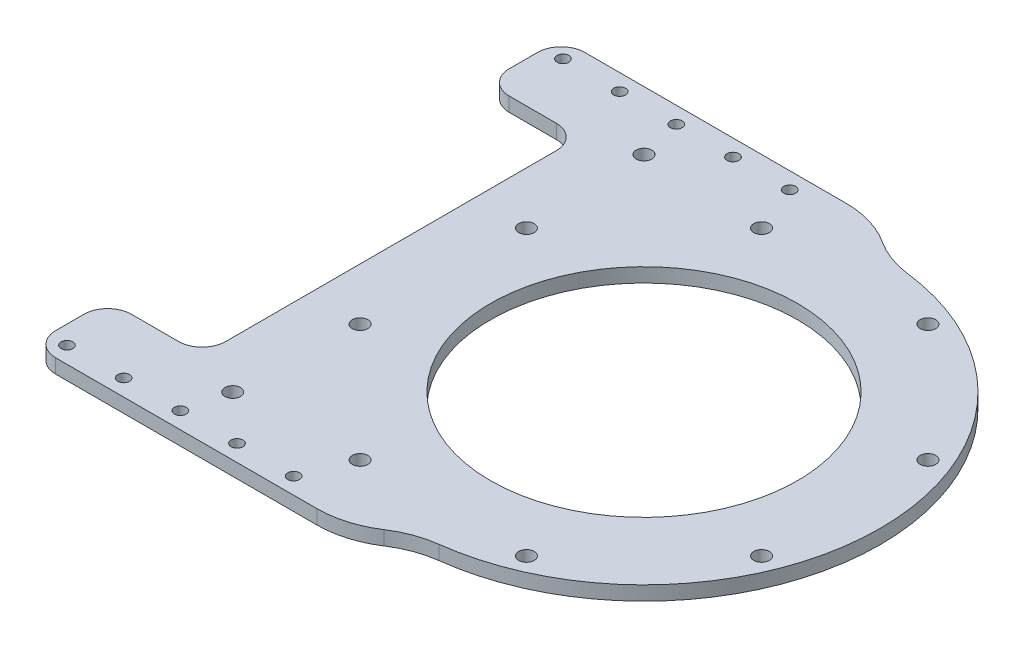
ISO-10303-21;
HEADER;
FILE_DESCRIPTION(('STEP AP214'),'2;1');
FILE_NAME('part.step','',(''),(''),'','','');
FILE_SCHEMA(('AUTOMOTIVE_DESIGN { 1 0 10303 214 1 1 1 1 }'));
ENDSEC;
DATA;
#1=APPLICATION_CONTEXT('core data for automotive mechanical design processes');
#2=APPLICATION_PROTOCOL_DEFINITION('international standard','automotive_design',2000,#1);
#3=PRODUCT_CONTEXT('',#1,'mechanical');
#4=PRODUCT('Part','Part','',(#3));
#5=PRODUCT_RELATED_PRODUCT_CATEGORY('part','',(#4));
#6=PRODUCT_DEFINITION_FORMATION('','',#4);
#7=PRODUCT_DEFINITION_CONTEXT('part definition',#1,'design');
#8=PRODUCT_DEFINITION('design','',#6,#7);
#9=PRODUCT_DEFINITION_SHAPE('','',#8);
#10=(LENGTH_UNIT() NAMED_UNIT(*) SI_UNIT(.MILLI.,.METRE.));
#11=(NAMED_UNIT(*) PLANE_ANGLE_UNIT() SI_UNIT($,.RADIAN.));
#12=(NAMED_UNIT(*) SI_UNIT($,.STERADIAN.) SOLID_ANGLE_UNIT());
#13=UNCERTAINTY_MEASURE_WITH_UNIT(LENGTH_MEASURE(1.E-05),#10,'distance_accuracy_value','');
#14=(GEOMETRIC_REPRESENTATION_CONTEXT(3) GLOBAL_UNCERTAINTY_ASSIGNED_CONTEXT((#13)) GLOBAL_UNIT_ASSIGNED_CONTEXT((#10,
#11,#12)) REPRESENTATION_CONTEXT('',''));
#15=CARTESIAN_POINT('',(0.,0.,0.));
#16=DIRECTION('',(0.,0.,1.));
#17=DIRECTION('',(1.,0.,0.));
#18=AXIS2_PLACEMENT_3D('',#15,#16,#17);
#19=CARTESIAN_POINT('',(83.4007857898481,3.,-81.060672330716));
#20=DIRECTION('',(1.,0.,0.));
#21=DIRECTION('',(0.,0.,-1.));
#22=AXIS2_PLACEMENT_3D('',#19,#20,#21);
#23=PLANE('',#22);
#24=DIRECTION('',(0.,1.,0.));
#25=VECTOR('',#24,1.);
#26=CARTESIAN_POINT('',(83.4007857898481,3.,45.));
#27=LINE('',#26,#25);
#28=CARTESIAN_POINT('',(83.4007857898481,0.,45.));
#29=VERTEX_POINT('',#28);
#30=CARTESIAN_POINT('',(83.4007857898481,3.,45.));
#31=VERTEX_POINT('',#30);
#32=EDGE_CURVE('E11',#29,#31,#27,.T.);
#33=ORIENTED_EDGE('',*,*,#32,.F.);
#34=DIRECTION('',(0.,0.,1.));
#35=VECTOR('',#34,1.);
#36=CARTESIAN_POINT('',(83.4007857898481,0.,0.));
#37=LINE('',#36,#35);
#38=CARTESIAN_POINT('',(83.4007857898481,0.,51.));
#39=VERTEX_POINT('',#38);
#40=EDGE_CURVE('E152',#39,#29,#37,.F.);
#41=ORIENTED_EDGE('',*,*,#40,.F.);
#42=DIRECTION('',(0.,1.,0.));
#43=VECTOR('',#42,1.);
#44=CARTESIAN_POINT('',(83.4007857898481,3.,51.));
#45=LINE('',#44,#43);
#46=CARTESIAN_POINT('',(83.4007857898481,3.,51.));
#47=VERTEX_POINT('',#46);
#48=EDGE_CURVE('E64',#39,#47,#45,.T.);
#49=ORIENTED_EDGE('',*,*,#48,.T.);
#50=DIRECTION('',(0.,0.,-1.));
#51=VECTOR('',#50,1.);
#52=CARTESIAN_POINT('',(83.4007857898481,3.,-81.060672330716));
#53=LINE('',#52,#51);
#54=EDGE_CURVE('E292',#47,#31,#53,.T.);
#55=ORIENTED_EDGE('',*,*,#54,.T.);
#56=EDGE_LOOP('',(#33,#41,#49,#55));
#57=FACE_BOUND('',#56,.T.);
#58=ADVANCED_FACE('F53',(#57),#23,.F.);
#59=CARTESIAN_POINT('',(88.4007857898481,3.,51.));
#60=DIRECTION('',(0.,1.,0.));
#61=DIRECTION('',(0.,0.,1.));
#62=AXIS2_PLACEMENT_3D('',#59,#60,#61);
#63=CYLINDRICAL_SURFACE('',#62,5.);
#64=ORIENTED_EDGE('',*,*,#48,.F.);
#65=CARTESIAN_POINT('',(88.4007857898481,0.,51.));
#66=DIRECTION('',(0.,1.,0.));
#67=DIRECTION('',(0.,0.,1.));
#68=AXIS2_PLACEMENT_3D('',#65,#66,#67);
#69=CIRCLE('',#68,5.);
#70=CARTESIAN_POINT('',(88.4007857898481,0.,56.));
#71=VERTEX_POINT('',#70);
#72=EDGE_CURVE('E224',#39,#71,#69,.T.);
#73=ORIENTED_EDGE('',*,*,#72,.T.);
#74=DIRECTION('',(0.,1.,0.));
#75=VECTOR('',#74,1.);
#76=CARTESIAN_POINT('',(88.4007857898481,3.,56.));
#77=LINE('',#76,#75);
#78=CARTESIAN_POINT('',(88.4007857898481,3.,56.));
#79=VERTEX_POINT('',#78);
#80=EDGE_CURVE('E283',#71,#79,#77,.T.);
#81=ORIENTED_EDGE('',*,*,#80,.T.);
#82=CARTESIAN_POINT('',(88.4007857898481,3.,51.));
#83=DIRECTION('',(0.,1.,0.));
#84=DIRECTION('',(0.,0.,1.));
#85=AXIS2_PLACEMENT_3D('',#82,#83,#84);
#86=CIRCLE('',#85,5.);
#87=EDGE_CURVE('E301',#47,#79,#86,.T.);
#88=ORIENTED_EDGE('',*,*,#87,.F.);
#89=EDGE_LOOP('',(#64,#73,#81,#88));
#90=FACE_BOUND('',#89,.T.);
#91=ADVANCED_FACE('F306',(#90),#63,.T.);
#92=CARTESIAN_POINT('',(-100.,3.,56.));
#93=DIRECTION('',(0.,0.,1.));
#94=DIRECTION('',(1.,0.,0.));
#95=AXIS2_PLACEMENT_3D('',#92,#93,#94);
#96=PLANE('',#95);
#97=ORIENTED_EDGE('',*,*,#80,.F.);
#98=DIRECTION('',(1.,0.,0.));
#99=VECTOR('',#98,1.);
#100=CARTESIAN_POINT('',(0.,0.,56.));
#101=LINE('',#100,#99);
#102=CARTESIAN_POINT('',(143.705644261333,0.,56.));
#103=VERTEX_POINT('',#102);
#104=EDGE_CURVE('E220',#71,#103,#101,.T.);
#105=ORIENTED_EDGE('',*,*,#104,.T.);
#106=DIRECTION('',(0.,1.,0.));
#107=VECTOR('',#106,1.);
#108=CARTESIAN_POINT('',(143.705644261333,3.,56.));
#109=LINE('',#108,#107);
#110=CARTESIAN_POINT('',(143.705644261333,3.,56.));
#111=VERTEX_POINT('',#110);
#112=EDGE_CURVE('E279',#103,#111,#109,.T.);
#113=ORIENTED_EDGE('',*,*,#112,.T.);
#114=DIRECTION('',(1.,0.,0.));
#115=VECTOR('',#114,1.);
#116=CARTESIAN_POINT('',(-100.,3.,56.));
#117=LINE('',#116,#115);
#118=EDGE_CURVE('E308',#79,#111,#117,.T.);
#119=ORIENTED_EDGE('',*,*,#118,.F.);
#120=EDGE_LOOP('',(#97,#105,#113,#119));
#121=FACE_BOUND('',#120,.T.);
#122=ADVANCED_FACE('F466',(#121),#96,.T.);
#123=CARTESIAN_POINT('',(143.705644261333,3.,36.));
#124=DIRECTION('',(0.,1.,0.));
#125=DIRECTION('',(0.,0.,1.));
#126=AXIS2_PLACEMENT_3D('',#123,#124,#125);
#127=CYLINDRICAL_SURFACE('',#126,20.);
#128=ORIENTED_EDGE('',*,*,#112,.F.);
#129=CARTESIAN_POINT('',(143.705644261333,0.,36.));
#130=DIRECTION('',(0.,1.,0.));
#131=DIRECTION('',(0.,0.,1.));
#132=AXIS2_PLACEMENT_3D('',#129,#130,#131);
#133=CIRCLE('',#132,20.);
#134=CARTESIAN_POINT('',(154.665979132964,0.,52.7293472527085));
#135=VERTEX_POINT('',#134);
#136=EDGE_CURVE('E216',#103,#135,#133,.T.);
#137=ORIENTED_EDGE('',*,*,#136,.T.);
#138=DIRECTION('',(0.,1.,0.));
#139=VECTOR('',#138,1.);
#140=CARTESIAN_POINT('',(154.665979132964,3.,52.7293472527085));
#141=LINE('',#140,#139);
#142=CARTESIAN_POINT('',(154.665979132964,3.,52.7293472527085));
#143=VERTEX_POINT('',#142);
#144=EDGE_CURVE('E275',#135,#143,#141,.T.);
#145=ORIENTED_EDGE('',*,*,#144,.T.);
#146=CARTESIAN_POINT('',(143.705644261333,3.,36.));
#147=DIRECTION('',(0.,1.,0.));
#148=DIRECTION('',(0.,0.,1.));
#149=AXIS2_PLACEMENT_3D('',#146,#147,#148);
#150=CIRCLE('',#149,20.);
#151=EDGE_CURVE('E313',#111,#143,#150,.T.);
#152=ORIENTED_EDGE('',*,*,#151,.F.);
#153=EDGE_LOOP('',(#128,#137,#145,#152));
#154=FACE_BOUND('',#153,.T.);
#155=ADVANCED_FACE('F958',(#154),#127,.T.);
#156=CARTESIAN_POINT('',(165.626314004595,3.,69.458694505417));
#157=DIRECTION('',(0.,1.,0.));
#158=DIRECTION('',(0.,0.,1.));
#159=AXIS2_PLACEMENT_3D('',#156,#157,#158);
#160=CYLINDRICAL_SURFACE('',#159,20.);
#161=ORIENTED_EDGE('',*,*,#144,.F.);
#162=CARTESIAN_POINT('',(165.626314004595,0.,69.458694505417));
#163=DIRECTION('',(0.,1.,0.));
#164=DIRECTION('',(0.,0.,1.));
#165=AXIS2_PLACEMENT_3D('',#162,#163,#164);
#166=CIRCLE('',#165,20.);
#167=CARTESIAN_POINT('',(163.14388994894,0.,49.613353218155));
#168=VERTEX_POINT('',#167);
#169=EDGE_CURVE('E212',#135,#168,#166,.F.);
#170=ORIENTED_EDGE('',*,*,#169,.T.);
#171=DIRECTION('',(0.,1.,0.));
#172=VECTOR('',#171,1.);
#173=CARTESIAN_POINT('',(163.14388994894,3.,49.613353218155));
#174=LINE('',#173,#172);
#175=CARTESIAN_POINT('',(163.14388994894,3.,49.613353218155));
#176=VERTEX_POINT('',#175);
#177=EDGE_CURVE('E271',#168,#176,#174,.T.);
#178=ORIENTED_EDGE('',*,*,#177,.T.);
#179=CARTESIAN_POINT('',(165.626314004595,3.,69.458694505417));
#180=DIRECTION('',(0.,1.,0.));
#181=DIRECTION('',(0.,0.,1.));
#182=AXIS2_PLACEMENT_3D('',#179,#180,#181);
#183=CIRCLE('',#182,20.);
#184=EDGE_CURVE('E320',#143,#176,#183,.F.);
#185=ORIENTED_EDGE('',*,*,#184,.F.);
#186=EDGE_LOOP('',(#161,#170,#178,#185));
#187=FACE_BOUND('',#186,.T.);
#188=ADVANCED_FACE('F948',(#187),#160,.F.);
#189=CARTESIAN_POINT('',(156.937829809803,3.,0.));
#190=DIRECTION('',(0.,1.,0.));
#191=DIRECTION('',(0.,0.,1.));
#192=AXIS2_PLACEMENT_3D('',#189,#190,#191);
#193=CYLINDRICAL_SURFACE('',#192,50.);
#194=ORIENTED_EDGE('',*,*,#177,.F.);
#195=CARTESIAN_POINT('',(156.937829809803,0.,0.));
#196=DIRECTION('',(0.,1.,0.));
#197=DIRECTION('',(0.,0.,1.));
#198=AXIS2_PLACEMENT_3D('',#195,#196,#197);
#199=CIRCLE('',#198,50.);
#200=CARTESIAN_POINT('',(163.14388994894,0.,-49.613353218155));
#201=VERTEX_POINT('',#200);
#202=EDGE_CURVE('E208',#168,#201,#199,.T.);
#203=ORIENTED_EDGE('',*,*,#202,.T.);
#204=DIRECTION('',(0.,1.,0.));
#205=VECTOR('',#204,1.);
#206=CARTESIAN_POINT('',(163.14388994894,3.,-49.613353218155));
#207=LINE('',#206,#205);
#208=CARTESIAN_POINT('',(163.14388994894,3.,-49.613353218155));
#209=VERTEX_POINT('',#208);
#210=EDGE_CURVE('E267',#201,#209,#207,.T.);
#211=ORIENTED_EDGE('',*,*,#210,.T.);
#212=CARTESIAN_POINT('',(156.937829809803,3.,0.));
#213=DIRECTION('',(0.,1.,0.));
#214=DIRECTION('',(0.,0.,1.));
#215=AXIS2_PLACEMENT_3D('',#212,#213,#214);
#216=CIRCLE('',#215,50.);
#217=EDGE_CURVE('E324',#176,#209,#216,.T.);
#218=ORIENTED_EDGE('',*,*,#217,.F.);
#219=EDGE_LOOP('',(#194,#203,#211,#218));
#220=FACE_BOUND('',#219,.T.);
#221=ADVANCED_FACE('F939',(#220),#193,.T.);
#222=CARTESIAN_POINT('',(165.626314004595,3.,-69.458694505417));
#223=DIRECTION('',(0.,1.,0.));
#224=DIRECTION('',(0.,0.,1.));
#225=AXIS2_PLACEMENT_3D('',#222,#223,#224);
#226=CYLINDRICAL_SURFACE('',#225,20.);
#227=ORIENTED_EDGE('',*,*,#210,.F.);
#228=CARTESIAN_POINT('',(165.626314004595,0.,-69.458694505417));
#229=DIRECTION('',(0.,1.,0.));
#230=DIRECTION('',(0.,0.,1.));
#231=AXIS2_PLACEMENT_3D('',#228,#229,#230);
#232=CIRCLE('',#231,20.);
#233=CARTESIAN_POINT('',(154.665979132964,0.,-52.7293472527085));
#234=VERTEX_POINT('',#233);
#235=EDGE_CURVE('E204',#201,#234,#232,.F.);
#236=ORIENTED_EDGE('',*,*,#235,.T.);
#237=DIRECTION('',(0.,1.,0.));
#238=VECTOR('',#237,1.);
#239=CARTESIAN_POINT('',(154.665979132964,3.,-52.7293472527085));
#240=LINE('',#239,#238);
#241=CARTESIAN_POINT('',(154.665979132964,3.,-52.7293472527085));
#242=VERTEX_POINT('',#241);
#243=EDGE_CURVE('E263',#234,#242,#240,.T.);
#244=ORIENTED_EDGE('',*,*,#243,.T.);
#245=CARTESIAN_POINT('',(165.626314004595,3.,-69.458694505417));
#246=DIRECTION('',(0.,1.,0.));
#247=DIRECTION('',(0.,0.,1.));
#248=AXIS2_PLACEMENT_3D('',#245,#246,#247);
#249=CIRCLE('',#248,20.);
#250=EDGE_CURVE('E328',#209,#242,#249,.F.);
#251=ORIENTED_EDGE('',*,*,#250,.F.);
#252=EDGE_LOOP('',(#227,#236,#244,#251));
#253=FACE_BOUND('',#252,.T.);
#254=ADVANCED_FACE('F930',(#253),#226,.F.);
#255=CARTESIAN_POINT('',(143.705644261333,3.,-36.));
#256=DIRECTION('',(0.,1.,0.));
#257=DIRECTION('',(0.,0.,1.));
#258=AXIS2_PLACEMENT_3D('',#255,#256,#257);
#259=CYLINDRICAL_SURFACE('',#258,20.);
#260=ORIENTED_EDGE('',*,*,#243,.F.);
#261=CARTESIAN_POINT('',(143.705644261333,0.,-36.));
#262=DIRECTION('',(0.,1.,0.));
#263=DIRECTION('',(0.,0.,1.));
#264=AXIS2_PLACEMENT_3D('',#261,#262,#263);
#265=CIRCLE('',#264,20.);
#266=CARTESIAN_POINT('',(143.705644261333,0.,-56.));
#267=VERTEX_POINT('',#266);
#268=EDGE_CURVE('E200',#234,#267,#265,.T.);
#269=ORIENTED_EDGE('',*,*,#268,.T.);
#270=DIRECTION('',(0.,1.,0.));
#271=VECTOR('',#270,1.);
#272=CARTESIAN_POINT('',(143.705644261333,3.,-56.));
#273=LINE('',#272,#271);
#274=CARTESIAN_POINT('',(143.705644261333,3.,-56.));
#275=VERTEX_POINT('',#274);
#276=EDGE_CURVE('E259',#267,#275,#273,.T.);
#277=ORIENTED_EDGE('',*,*,#276,.T.);
#278=CARTESIAN_POINT('',(143.705644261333,3.,-36.));
#279=DIRECTION('',(0.,1.,0.));
#280=DIRECTION('',(0.,0.,1.));
#281=AXIS2_PLACEMENT_3D('',#278,#279,#280);
#282=CIRCLE('',#281,20.);
#283=EDGE_CURVE('E332',#242,#275,#282,.T.);
#284=ORIENTED_EDGE('',*,*,#283,.F.);
#285=EDGE_LOOP('',(#260,#269,#277,#284));
#286=FACE_BOUND('',#285,.T.);
#287=ADVANCED_FACE('F498',(#286),#259,.T.);
#288=CARTESIAN_POINT('',(-100.,3.,-56.));
#289=DIRECTION('',(0.,0.,-1.));
#290=DIRECTION('',(-1.,0.,0.));
#291=AXIS2_PLACEMENT_3D('',#288,#289,#290);
#292=PLANE('',#291);
#293=ORIENTED_EDGE('',*,*,#276,.F.);
#294=DIRECTION('',(1.,0.,0.));
#295=VECTOR('',#294,1.);
#296=CARTESIAN_POINT('',(0.,0.,-56.));
#297=LINE('',#296,#295);
#298=CARTESIAN_POINT('',(88.4007857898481,0.,-56.));
#299=VERTEX_POINT('',#298);
#300=EDGE_CURVE('E196',#267,#299,#297,.F.);
#301=ORIENTED_EDGE('',*,*,#300,.T.);
#302=DIRECTION('',(0.,1.,0.));
#303=VECTOR('',#302,1.);
#304=CARTESIAN_POINT('',(88.4007857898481,3.,-56.));
#305=LINE('',#304,#303);
#306=CARTESIAN_POINT('',(88.4007857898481,3.,-56.));
#307=VERTEX_POINT('',#306);
#308=EDGE_CURVE('E255',#299,#307,#305,.T.);
#309=ORIENTED_EDGE('',*,*,#308,.T.);
#310=DIRECTION('',(-1.,0.,0.));
#311=VECTOR('',#310,1.);
#312=CARTESIAN_POINT('',(-100.,3.,-56.));
#313=LINE('',#312,#311);
#314=EDGE_CURVE('E336',#275,#307,#313,.T.);
#315=ORIENTED_EDGE('',*,*,#314,.F.);
#316=EDGE_LOOP('',(#293,#301,#309,#315));
#317=FACE_BOUND('',#316,.T.);
#318=ADVANCED_FACE('F478',(#317),#292,.T.);
#319=CARTESIAN_POINT('',(88.4007857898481,3.,-51.));
#320=DIRECTION('',(0.,1.,0.));
#321=DIRECTION('',(0.,0.,1.));
#322=AXIS2_PLACEMENT_3D('',#319,#320,#321);
#323=CYLINDRICAL_SURFACE('',#322,5.);
#324=ORIENTED_EDGE('',*,*,#308,.F.);
#325=CARTESIAN_POINT('',(88.4007857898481,0.,-51.));
#326=DIRECTION('',(0.,1.,0.));
#327=DIRECTION('',(0.,0.,1.));
#328=AXIS2_PLACEMENT_3D('',#325,#326,#327);
#329=CIRCLE('',#328,5.);
#330=CARTESIAN_POINT('',(83.4007857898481,0.,-51.));
#331=VERTEX_POINT('',#330);
#332=EDGE_CURVE('E192',#299,#331,#329,.T.);
#333=ORIENTED_EDGE('',*,*,#332,.T.);
#334=DIRECTION('',(0.,1.,0.));
#335=VECTOR('',#334,1.);
#336=CARTESIAN_POINT('',(83.4007857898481,3.,-51.));
#337=LINE('',#336,#335);
#338=CARTESIAN_POINT('',(83.4007857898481,3.,-51.));
#339=VERTEX_POINT('',#338);
#340=EDGE_CURVE('E251',#331,#339,#337,.T.);
#341=ORIENTED_EDGE('',*,*,#340,.T.);
#342=CARTESIAN_POINT('',(88.4007857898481,3.,-51.));
#343=DIRECTION('',(0.,1.,0.));
#344=DIRECTION('',(0.,0.,1.));
#345=AXIS2_PLACEMENT_3D('',#342,#343,#344);
#346=CIRCLE('',#345,5.);
#347=EDGE_CURVE('E340',#307,#339,#346,.T.);
#348=ORIENTED_EDGE('',*,*,#347,.F.);
#349=EDGE_LOOP('',(#324,#333,#341,#348));
#350=FACE_BOUND('',#349,.T.);
#351=ADVANCED_FACE('F471',(#350),#323,.T.);
#352=ORIENTED_EDGE('',*,*,#340,.F.);
#353=DIRECTION('',(0.,0.,1.));
#354=VECTOR('',#353,1.);
#355=CARTESIAN_POINT('',(83.4007857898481,0.,0.));
#356=LINE('',#355,#354);
#357=CARTESIAN_POINT('',(83.4007857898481,0.,-45.));
#358=VERTEX_POINT('',#357);
#359=EDGE_CURVE('E188',#358,#331,#356,.F.);
#360=ORIENTED_EDGE('',*,*,#359,.F.);
#361=DIRECTION('',(0.,1.,0.));
#362=VECTOR('',#361,1.);
#363=CARTESIAN_POINT('',(83.4007857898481,3.,-45.));
#364=LINE('',#363,#362);
#365=CARTESIAN_POINT('',(83.4007857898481,3.,-45.));
#366=VERTEX_POINT('',#365);
#367=EDGE_CURVE('E247',#358,#366,#364,.T.);
#368=ORIENTED_EDGE('',*,*,#367,.T.);
#369=EDGE_CURVE('E305',#366,#339,#53,.T.);
#370=ORIENTED_EDGE('',*,*,#369,.T.);
#371=EDGE_LOOP('',(#352,#360,#368,#370));
#372=FACE_BOUND('',#371,.T.);
#373=ADVANCED_FACE('F463',(#372),#23,.F.);
#374=CARTESIAN_POINT('',(88.4007857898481,3.,-45.));
#375=DIRECTION('',(0.,1.,0.));
#376=DIRECTION('',(0.,0.,1.));
#377=AXIS2_PLACEMENT_3D('',#374,#375,#376);
#378=CYLINDRICAL_SURFACE('',#377,5.);
#379=ORIENTED_EDGE('',*,*,#367,.F.);
#380=CARTESIAN_POINT('',(88.4007857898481,0.,-45.));
#381=DIRECTION('',(0.,1.,0.));
#382=DIRECTION('',(0.,0.,1.));
#383=AXIS2_PLACEMENT_3D('',#380,#381,#382);
#384=CIRCLE('',#383,5.);
#385=CARTESIAN_POINT('',(88.4007857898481,0.,-40.));
#386=VERTEX_POINT('',#385);
#387=EDGE_CURVE('E184',#358,#386,#384,.T.);
#388=ORIENTED_EDGE('',*,*,#387,.T.);
#389=DIRECTION('',(0.,1.,0.));
#390=VECTOR('',#389,1.);
#391=CARTESIAN_POINT('',(88.4007857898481,3.,-40.));
#392=LINE('',#391,#390);
#393=CARTESIAN_POINT('',(88.4007857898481,3.,-40.));
#394=VERTEX_POINT('',#393);
#395=EDGE_CURVE('E243',#386,#394,#392,.T.);
#396=ORIENTED_EDGE('',*,*,#395,.T.);
#397=CARTESIAN_POINT('',(88.4007857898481,3.,-45.));
#398=DIRECTION('',(0.,1.,0.));
#399=DIRECTION('',(0.,0.,1.));
#400=AXIS2_PLACEMENT_3D('',#397,#398,#399);
#401=CIRCLE('',#400,5.);
#402=EDGE_CURVE('E344',#366,#394,#401,.T.);
#403=ORIENTED_EDGE('',*,*,#402,.F.);
#404=EDGE_LOOP('',(#379,#388,#396,#403));
#405=FACE_BOUND('',#404,.T.);
#406=ADVANCED_FACE('F470',(#405),#378,.T.);
#407=CARTESIAN_POINT('',(0.,3.,-40.));
#408=DIRECTION('',(0.,0.,-1.));
#409=DIRECTION('',(-1.,0.,0.));
#410=AXIS2_PLACEMENT_3D('',#407,#408,#409);
#411=PLANE('',#410);
#412=ORIENTED_EDGE('',*,*,#395,.F.);
#413=DIRECTION('',(1.,0.,0.));
#414=VECTOR('',#413,1.);
#415=CARTESIAN_POINT('',(0.,0.,-40.));
#416=LINE('',#415,#414);
#417=CARTESIAN_POINT('',(98.4007857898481,0.,-40.));
#418=VERTEX_POINT('',#417);
#419=EDGE_CURVE('E180',#418,#386,#416,.F.);
#420=ORIENTED_EDGE('',*,*,#419,.F.);
#421=DIRECTION('',(0.,1.,0.));
#422=VECTOR('',#421,1.);
#423=CARTESIAN_POINT('',(98.4007857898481,3.,-40.));
#424=LINE('',#423,#422);
#425=CARTESIAN_POINT('',(98.4007857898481,3.,-40.));
#426=VERTEX_POINT('',#425);
#427=EDGE_CURVE('E239',#418,#426,#424,.T.);
#428=ORIENTED_EDGE('',*,*,#427,.T.);
#429=DIRECTION('',(-1.,0.,0.));
#430=VECTOR('',#429,1.);
#431=CARTESIAN_POINT('',(0.,3.,-40.));
#432=LINE('',#431,#430);
#433=EDGE_CURVE('E348',#426,#394,#432,.T.);
#434=ORIENTED_EDGE('',*,*,#433,.T.);
#435=EDGE_LOOP('',(#412,#420,#428,#434));
#436=FACE_BOUND('',#435,.T.);
#437=ADVANCED_FACE('F476',(#436),#411,.F.);
#438=CARTESIAN_POINT('',(98.4007857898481,3.,-35.));
#439=DIRECTION('',(0.,1.,0.));
#440=DIRECTION('',(0.,0.,1.));
#441=AXIS2_PLACEMENT_3D('',#438,#439,#440);
#442=CYLINDRICAL_SURFACE('',#441,5.);
#443=ORIENTED_EDGE('',*,*,#427,.F.);
#444=CARTESIAN_POINT('',(98.4007857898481,0.,-35.));
#445=DIRECTION('',(0.,1.,0.));
#446=DIRECTION('',(0.,0.,1.));
#447=AXIS2_PLACEMENT_3D('',#444,#445,#446);
#448=CIRCLE('',#447,5.);
#449=CARTESIAN_POINT('',(103.400785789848,0.,-35.));
#450=VERTEX_POINT('',#449);
#451=EDGE_CURVE('E176',#418,#450,#448,.F.);
#452=ORIENTED_EDGE('',*,*,#451,.T.);
#453=DIRECTION('',(0.,1.,0.));
#454=VECTOR('',#453,1.);
#455=CARTESIAN_POINT('',(103.400785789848,3.,-35.));
#456=LINE('',#455,#454);
#457=CARTESIAN_POINT('',(103.400785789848,3.,-35.));
#458=VERTEX_POINT('',#457);
#459=EDGE_CURVE('E235',#450,#458,#456,.T.);
#460=ORIENTED_EDGE('',*,*,#459,.T.);
#461=CARTESIAN_POINT('',(98.4007857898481,3.,-35.));
#462=DIRECTION('',(0.,1.,0.));
#463=DIRECTION('',(0.,0.,1.));
#464=AXIS2_PLACEMENT_3D('',#461,#462,#463);
#465=CIRCLE('',#464,5.);
#466=EDGE_CURVE('E352',#426,#458,#465,.F.);
#467=ORIENTED_EDGE('',*,*,#466,.F.);
#468=EDGE_LOOP('',(#443,#452,#460,#467));
#469=FACE_BOUND('',#468,.T.);
#470=ADVANCED_FACE('F515',(#469),#442,.F.);
#471=CARTESIAN_POINT('',(103.400785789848,3.,0.));
#472=DIRECTION('',(1.,0.,0.));
#473=DIRECTION('',(0.,0.,-1.));
#474=AXIS2_PLACEMENT_3D('',#471,#472,#473);
#475=PLANE('',#474);
#476=ORIENTED_EDGE('',*,*,#459,.F.);
#477=DIRECTION('',(0.,0.,1.));
#478=VECTOR('',#477,1.);
#479=CARTESIAN_POINT('',(103.400785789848,0.,0.));
#480=LINE('',#479,#478);
#481=CARTESIAN_POINT('',(103.400785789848,0.,35.));
#482=VERTEX_POINT('',#481);
#483=EDGE_CURVE('E172',#482,#450,#480,.F.);
#484=ORIENTED_EDGE('',*,*,#483,.F.);
#485=DIRECTION('',(0.,1.,0.));
#486=VECTOR('',#485,1.);
#487=CARTESIAN_POINT('',(103.400785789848,3.,35.));
#488=LINE('',#487,#486);
#489=CARTESIAN_POINT('',(103.400785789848,3.,35.));
#490=VERTEX_POINT('',#489);
#491=EDGE_CURVE('E232',#482,#490,#488,.T.);
#492=ORIENTED_EDGE('',*,*,#491,.T.);
#493=DIRECTION('',(0.,0.,-1.));
#494=VECTOR('',#493,1.);
#495=CARTESIAN_POINT('',(103.400785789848,3.,0.));
#496=LINE('',#495,#494);
#497=EDGE_CURVE('E356',#490,#458,#496,.T.);
#498=ORIENTED_EDGE('',*,*,#497,.T.);
#499=EDGE_LOOP('',(#476,#484,#492,#498));
#500=FACE_BOUND('',#499,.T.);
#501=ADVANCED_FACE('F521',(#500),#475,.F.);
#502=CARTESIAN_POINT('',(98.4007857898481,3.,35.));
#503=DIRECTION('',(0.,1.,0.));
#504=DIRECTION('',(0.,0.,1.));
#505=AXIS2_PLACEMENT_3D('',#502,#503,#504);
#506=CYLINDRICAL_SURFACE('',#505,5.);
#507=ORIENTED_EDGE('',*,*,#491,.F.);
#508=CARTESIAN_POINT('',(98.4007857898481,0.,35.));
#509=DIRECTION('',(0.,1.,0.));
#510=DIRECTION('',(0.,0.,1.));
#511=AXIS2_PLACEMENT_3D('',#508,#509,#510);
#512=CIRCLE('',#511,5.);
#513=CARTESIAN_POINT('',(98.4007857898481,0.,40.));
#514=VERTEX_POINT('',#513);
#515=EDGE_CURVE('E168',#482,#514,#512,.F.);
#516=ORIENTED_EDGE('',*,*,#515,.T.);
#517=DIRECTION('',(0.,1.,0.));
#518=VECTOR('',#517,1.);
#519=CARTESIAN_POINT('',(98.4007857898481,3.,40.));
#520=LINE('',#519,#518);
#521=CARTESIAN_POINT('',(98.4007857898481,3.,40.));
#522=VERTEX_POINT('',#521);
#523=EDGE_CURVE('E72',#514,#522,#520,.T.);
#524=ORIENTED_EDGE('',*,*,#523,.T.);
#525=CARTESIAN_POINT('',(98.4007857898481,3.,35.));
#526=DIRECTION('',(0.,1.,0.));
#527=DIRECTION('',(0.,0.,1.));
#528=AXIS2_PLACEMENT_3D('',#525,#526,#527);
#529=CIRCLE('',#528,5.);
#530=EDGE_CURVE('E145',#490,#522,#529,.F.);
#531=ORIENTED_EDGE('',*,*,#530,.F.);
#532=EDGE_LOOP('',(#507,#516,#524,#531));
#533=FACE_BOUND('',#532,.T.);
#534=ADVANCED_FACE('F522',(#533),#506,.F.);
#535=CARTESIAN_POINT('',(0.,3.,40.));
#536=DIRECTION('',(0.,0.,-1.));
#537=DIRECTION('',(-1.,0.,0.));
#538=AXIS2_PLACEMENT_3D('',#535,#536,#537);
#539=PLANE('',#538);
#540=ORIENTED_EDGE('',*,*,#523,.F.);
#541=DIRECTION('',(1.,0.,0.));
#542=VECTOR('',#541,1.);
#543=CARTESIAN_POINT('',(0.,0.,40.));
#544=LINE('',#543,#542);
#545=CARTESIAN_POINT('',(88.4007857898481,0.,40.));
#546=VERTEX_POINT('',#545);
#547=EDGE_CURVE('E150',#514,#546,#544,.F.);
#548=ORIENTED_EDGE('',*,*,#547,.T.);
#549=DIRECTION('',(0.,1.,0.));
#550=VECTOR('',#549,1.);
#551=CARTESIAN_POINT('',(88.4007857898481,3.,40.));
#552=LINE('',#551,#550);
#553=CARTESIAN_POINT('',(88.4007857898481,3.,40.));
#554=VERTEX_POINT('',#553);
#555=EDGE_CURVE('E57',#546,#554,#552,.T.);
#556=ORIENTED_EDGE('',*,*,#555,.T.);
#557=DIRECTION('',(-1.,0.,0.));
#558=VECTOR('',#557,1.);
#559=CARTESIAN_POINT('',(0.,3.,40.));
#560=LINE('',#559,#558);
#561=EDGE_CURVE('E523',#522,#554,#560,.T.);
#562=ORIENTED_EDGE('',*,*,#561,.F.);
#563=EDGE_LOOP('',(#540,#548,#556,#562));
#564=FACE_BOUND('',#563,.T.);
#565=ADVANCED_FACE('F155',(#564),#539,.T.);
#566=CARTESIAN_POINT('',(99.2778298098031,3.,52.4999999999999));
#567=DIRECTION('',(0.,1.,0.));
#568=DIRECTION('',(0.,0.,1.));
#569=AXIS2_PLACEMENT_3D('',#566,#567,#568);
#570=CYLINDRICAL_SURFACE('',#569,1.25);
#571=CARTESIAN_POINT('',(99.2778298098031,3.,52.4999999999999));
#572=DIRECTION('',(0.,-1.,0.));
#573=DIRECTION('',(0.,0.,-1.));
#574=AXIS2_PLACEMENT_3D('',#571,#572,#573);
#575=CIRCLE('',#574,1.25);
#576=CARTESIAN_POINT('',(99.2778298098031,3.,51.2499999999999));
#577=VERTEX_POINT('',#576);
#578=EDGE_CURVE('E171',#577,#577,#575,.T.);
#579=ORIENTED_EDGE('',*,*,#578,.F.);
#580=EDGE_LOOP('',(#579));
#581=FACE_BOUND('',#580,.T.);
#582=CARTESIAN_POINT('',(99.2778298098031,0.,52.4999999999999));
#583=DIRECTION('',(0.,-1.,0.));
#584=DIRECTION('',(0.,0.,-1.));
#585=AXIS2_PLACEMENT_3D('',#582,#583,#584);
#586=CIRCLE('',#585,1.25);
#587=CARTESIAN_POINT('',(99.2778298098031,0.,51.2499999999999));
#588=VERTEX_POINT('',#587);
#589=EDGE_CURVE('E363',#588,#588,#586,.T.);
#590=ORIENTED_EDGE('',*,*,#589,.T.);
#591=EDGE_LOOP('',(#590));
#592=FACE_BOUND('',#591,.T.);
#593=ADVANCED_FACE('F613',(#581,#592),#570,.F.);
#594=CARTESIAN_POINT('',(135.277829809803,3.,52.5));
#595=DIRECTION('',(0.,1.,0.));
#596=DIRECTION('',(0.,0.,1.));
#597=AXIS2_PLACEMENT_3D('',#594,#595,#596);
#598=CYLINDRICAL_SURFACE('',#597,1.25000000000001);
#599=CARTESIAN_POINT('',(135.277829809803,3.,52.5));
#600=DIRECTION('',(0.,1.,0.));
#601=DIRECTION('',(0.,0.,1.));
#602=AXIS2_PLACEMENT_3D('',#599,#600,#601);
#603=CIRCLE('',#602,1.25000000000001);
#604=CARTESIAN_POINT('',(135.277829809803,3.,53.75));
#605=VERTEX_POINT('',#604);
#606=EDGE_CURVE('E602',#605,#605,#603,.F.);
#607=ORIENTED_EDGE('',*,*,#606,.F.);
#608=EDGE_LOOP('',(#607));
#609=FACE_BOUND('',#608,.T.);
#610=CARTESIAN_POINT('',(135.277829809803,0.,52.5));
#611=DIRECTION('',(0.,1.,0.));
#612=DIRECTION('',(0.,0.,1.));
#613=AXIS2_PLACEMENT_3D('',#610,#611,#612);
#614=CIRCLE('',#613,1.25000000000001);
#615=CARTESIAN_POINT('',(135.277829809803,0.,53.75));
#616=VERTEX_POINT('',#615);
#617=EDGE_CURVE('E367',#616,#616,#614,.F.);
#618=ORIENTED_EDGE('',*,*,#617,.T.);
#619=EDGE_LOOP('',(#618));
#620=FACE_BOUND('',#619,.T.);
#621=ADVANCED_FACE('F616',(#609,#620),#598,.F.);
#622=CARTESIAN_POINT('',(123.277829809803,3.,52.4999999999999));
#623=DIRECTION('',(0.,1.,0.));
#624=DIRECTION('',(0.,0.,1.));
#625=AXIS2_PLACEMENT_3D('',#622,#623,#624);
#626=CYLINDRICAL_SURFACE('',#625,1.25);
#627=CARTESIAN_POINT('',(123.277829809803,3.,52.4999999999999));
#628=DIRECTION('',(0.,1.,0.));
#629=DIRECTION('',(0.,0.,1.));
#630=AXIS2_PLACEMENT_3D('',#627,#628,#629);
#631=CIRCLE('',#630,1.25);
#632=CARTESIAN_POINT('',(123.277829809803,3.,53.7499999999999));
#633=VERTEX_POINT('',#632);
#634=EDGE_CURVE('E598',#633,#633,#631,.F.);
#635=ORIENTED_EDGE('',*,*,#634,.F.);
#636=EDGE_LOOP('',(#635));
#637=FACE_BOUND('',#636,.T.);
#638=CARTESIAN_POINT('',(123.277829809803,0.,52.4999999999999));
#639=DIRECTION('',(0.,1.,0.));
#640=DIRECTION('',(0.,0.,1.));
#641=AXIS2_PLACEMENT_3D('',#638,#639,#640);
#642=CIRCLE('',#641,1.25);
#643=CARTESIAN_POINT('',(123.277829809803,0.,53.7499999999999));
#644=VERTEX_POINT('',#643);
#645=EDGE_CURVE('E371',#644,#644,#642,.F.);
#646=ORIENTED_EDGE('',*,*,#645,.T.);
#647=EDGE_LOOP('',(#646));
#648=FACE_BOUND('',#647,.T.);
#649=ADVANCED_FACE('F720',(#637,#648),#626,.F.);
#650=CARTESIAN_POINT('',(87.2778298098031,3.,52.5));
#651=DIRECTION('',(0.,1.,0.));
#652=DIRECTION('',(0.,0.,1.));
#653=AXIS2_PLACEMENT_3D('',#650,#651,#652);
#654=CYLINDRICAL_SURFACE('',#653,1.25);
#655=CARTESIAN_POINT('',(87.2778298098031,3.,52.5));
#656=DIRECTION('',(0.,-1.,0.));
#657=DIRECTION('',(0.,0.,-1.));
#658=AXIS2_PLACEMENT_3D('',#655,#656,#657);
#659=CIRCLE('',#658,1.25);
#660=CARTESIAN_POINT('',(87.2778298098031,3.,51.25));
#661=VERTEX_POINT('',#660);
#662=EDGE_CURVE('E594',#661,#661,#659,.T.);
#663=ORIENTED_EDGE('',*,*,#662,.F.);
#664=EDGE_LOOP('',(#663));
#665=FACE_BOUND('',#664,.T.);
#666=CARTESIAN_POINT('',(87.2778298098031,0.,52.5));
#667=DIRECTION('',(0.,-1.,0.));
#668=DIRECTION('',(0.,0.,-1.));
#669=AXIS2_PLACEMENT_3D('',#666,#667,#668);
#670=CIRCLE('',#669,1.25);
#671=CARTESIAN_POINT('',(87.2778298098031,0.,51.25));
#672=VERTEX_POINT('',#671);
#673=EDGE_CURVE('E375',#672,#672,#670,.T.);
#674=ORIENTED_EDGE('',*,*,#673,.T.);
#675=EDGE_LOOP('',(#674));
#676=FACE_BOUND('',#675,.T.);
#677=ADVANCED_FACE('F716',(#665,#676),#654,.F.);
#678=CARTESIAN_POINT('',(111.277829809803,3.,52.4999999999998));
#679=DIRECTION('',(0.,1.,0.));
#680=DIRECTION('',(0.,0.,1.));
#681=AXIS2_PLACEMENT_3D('',#678,#679,#680);
#682=CYLINDRICAL_SURFACE('',#681,1.25);
#683=CARTESIAN_POINT('',(111.277829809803,3.,52.4999999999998));
#684=DIRECTION('',(0.,1.,0.));
#685=DIRECTION('',(0.,0.,1.));
#686=AXIS2_PLACEMENT_3D('',#683,#684,#685);
#687=CIRCLE('',#686,1.25);
#688=CARTESIAN_POINT('',(111.277829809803,3.,53.7499999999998));
#689=VERTEX_POINT('',#688);
#690=EDGE_CURVE('E590',#689,#689,#687,.F.);
#691=ORIENTED_EDGE('',*,*,#690,.F.);
#692=EDGE_LOOP('',(#691));
#693=FACE_BOUND('',#692,.T.);
#694=CARTESIAN_POINT('',(111.277829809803,0.,52.4999999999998));
#695=DIRECTION('',(0.,1.,0.));
#696=DIRECTION('',(0.,0.,1.));
#697=AXIS2_PLACEMENT_3D('',#694,#695,#696);
#698=CIRCLE('',#697,1.25);
#699=CARTESIAN_POINT('',(111.277829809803,0.,53.7499999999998));
#700=VERTEX_POINT('',#699);
#701=EDGE_CURVE('E379',#700,#700,#698,.F.);
#702=ORIENTED_EDGE('',*,*,#701,.T.);
#703=EDGE_LOOP('',(#702));
#704=FACE_BOUND('',#703,.T.);
#705=ADVANCED_FACE('F712',(#693,#704),#682,.F.);
#706=CARTESIAN_POINT('',(156.937829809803,3.,0.));
#707=DIRECTION('',(0.,1.,0.));
#708=DIRECTION('',(0.,0.,1.));
#709=AXIS2_PLACEMENT_3D('',#706,#707,#708);
#710=CYLINDRICAL_SURFACE('',#709,32.5);
#711=CARTESIAN_POINT('',(156.937829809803,3.,0.));
#712=DIRECTION('',(0.,1.,0.));
#713=DIRECTION('',(0.,0.,1.));
#714=AXIS2_PLACEMENT_3D('',#711,#712,#713);
#715=CIRCLE('',#714,32.5);
#716=CARTESIAN_POINT('',(156.937829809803,3.,32.5));
#717=VERTEX_POINT('',#716);
#718=EDGE_CURVE('E586',#717,#717,#715,.T.);
#719=ORIENTED_EDGE('',*,*,#718,.T.);
#720=EDGE_LOOP('',(#719));
#721=FACE_BOUND('',#720,.T.);
#722=CARTESIAN_POINT('',(156.937829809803,0.,0.));
#723=DIRECTION('',(0.,1.,0.));
#724=DIRECTION('',(0.,0.,1.));
#725=AXIS2_PLACEMENT_3D('',#722,#723,#724);
#726=CIRCLE('',#725,32.5);
#727=CARTESIAN_POINT('',(156.937829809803,0.,32.5));
#728=VERTEX_POINT('',#727);
#729=EDGE_CURVE('E383',#728,#728,#726,.T.);
#730=ORIENTED_EDGE('',*,*,#729,.F.);
#731=EDGE_LOOP('',(#730));
#732=FACE_BOUND('',#731,.T.);
#733=ADVANCED_FACE('F708',(#721,#732),#710,.F.);
#734=CARTESIAN_POINT('',(113.400785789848,3.,43.5370440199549));
#735=DIRECTION('',(0.,1.,0.));
#736=DIRECTION('',(0.,0.,1.));
#737=AXIS2_PLACEMENT_3D('',#734,#735,#736);
#738=CYLINDRICAL_SURFACE('',#737,1.65);
#739=CARTESIAN_POINT('',(113.400785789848,3.,43.5370440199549));
#740=DIRECTION('',(0.,1.,0.));
#741=DIRECTION('',(0.,0.,1.));
#742=AXIS2_PLACEMENT_3D('',#739,#740,#741);
#743=CIRCLE('',#742,1.65);
#744=CARTESIAN_POINT('',(113.400785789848,3.,45.1870440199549));
#745=VERTEX_POINT('',#744);
#746=EDGE_CURVE('E582',#745,#745,#743,.F.);
#747=ORIENTED_EDGE('',*,*,#746,.F.);
#748=EDGE_LOOP('',(#747));
#749=FACE_BOUND('',#748,.T.);
#750=CARTESIAN_POINT('',(113.400785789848,0.,43.5370440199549));
#751=DIRECTION('',(0.,1.,0.));
#752=DIRECTION('',(0.,0.,1.));
#753=AXIS2_PLACEMENT_3D('',#750,#751,#752);
#754=CIRCLE('',#753,1.65);
#755=CARTESIAN_POINT('',(113.400785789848,0.,45.1870440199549));
#756=VERTEX_POINT('',#755);
#757=EDGE_CURVE('E387',#756,#756,#754,.F.);
#758=ORIENTED_EDGE('',*,*,#757,.T.);
#759=EDGE_LOOP('',(#758));
#760=FACE_BOUND('',#759,.T.);
#761=ADVANCED_FACE('F704',(#749,#760),#738,.F.);
#762=CARTESIAN_POINT('',(139.335954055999,3.,42.4991055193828));
#763=DIRECTION('',(0.,1.,0.));
#764=DIRECTION('',(0.,0.,1.));
#765=AXIS2_PLACEMENT_3D('',#762,#763,#764);
#766=CYLINDRICAL_SURFACE('',#765,1.65000000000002);
#767=CARTESIAN_POINT('',(139.335954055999,3.,42.4991055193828));
#768=DIRECTION('',(0.,1.,0.));
#769=DIRECTION('',(0.,0.,1.));
#770=AXIS2_PLACEMENT_3D('',#767,#768,#769);
#771=CIRCLE('',#770,1.65000000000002);
#772=CARTESIAN_POINT('',(139.335954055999,3.,44.1491055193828));
#773=VERTEX_POINT('',#772);
#774=EDGE_CURVE('E578',#773,#773,#771,.T.);
#775=ORIENTED_EDGE('',*,*,#774,.T.);
#776=EDGE_LOOP('',(#775));
#777=FACE_BOUND('',#776,.T.);
#778=CARTESIAN_POINT('',(139.335954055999,0.,42.4991055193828));
#779=DIRECTION('',(0.,1.,0.));
#780=DIRECTION('',(0.,0.,1.));
#781=AXIS2_PLACEMENT_3D('',#778,#779,#780);
#782=CIRCLE('',#781,1.65000000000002);
#783=CARTESIAN_POINT('',(139.335954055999,0.,44.1491055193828));
#784=VERTEX_POINT('',#783);
#785=EDGE_CURVE('E391',#784,#784,#782,.T.);
#786=ORIENTED_EDGE('',*,*,#785,.F.);
#787=EDGE_LOOP('',(#786));
#788=FACE_BOUND('',#787,.T.);
#789=ADVANCED_FACE('F700',(#777,#788),#766,.F.);
#790=CARTESIAN_POINT('',(174.539705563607,3.,-42.4991055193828));
#791=DIRECTION('',(0.,1.,0.));
#792=DIRECTION('',(0.,0.,1.));
#793=AXIS2_PLACEMENT_3D('',#790,#791,#792);
#794=CYLINDRICAL_SURFACE('',#793,1.65000000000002);
#795=CARTESIAN_POINT('',(174.539705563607,3.,-42.4991055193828));
#796=DIRECTION('',(0.,1.,0.));
#797=DIRECTION('',(0.,0.,1.));
#798=AXIS2_PLACEMENT_3D('',#795,#796,#797);
#799=CIRCLE('',#798,1.65000000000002);
#800=CARTESIAN_POINT('',(174.539705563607,3.,-40.8491055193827));
#801=VERTEX_POINT('',#800);
#802=EDGE_CURVE('E574',#801,#801,#799,.T.);
#803=ORIENTED_EDGE('',*,*,#802,.T.);
#804=EDGE_LOOP('',(#803));
#805=FACE_BOUND('',#804,.T.);
#806=CARTESIAN_POINT('',(174.539705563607,0.,-42.4991055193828));
#807=DIRECTION('',(0.,1.,0.));
#808=DIRECTION('',(0.,0.,1.));
#809=AXIS2_PLACEMENT_3D('',#806,#807,#808);
#810=CIRCLE('',#809,1.65000000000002);
#811=CARTESIAN_POINT('',(174.539705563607,0.,-40.8491055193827));
#812=VERTEX_POINT('',#811);
#813=EDGE_CURVE('E395',#812,#812,#810,.T.);
#814=ORIENTED_EDGE('',*,*,#813,.F.);
#815=EDGE_LOOP('',(#814));
#816=FACE_BOUND('',#815,.T.);
#817=ADVANCED_FACE('F696',(#805,#816),#794,.F.);
#818=CARTESIAN_POINT('',(139.332829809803,3.,-42.4978114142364));
#819=DIRECTION('',(0.,1.,0.));
#820=DIRECTION('',(0.,0.,1.));
#821=AXIS2_PLACEMENT_3D('',#818,#819,#820);
#822=CYLINDRICAL_SURFACE('',#821,1.65000000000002);
#823=CARTESIAN_POINT('',(139.332829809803,3.,-42.4978114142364));
#824=DIRECTION('',(0.,1.,0.));
#825=DIRECTION('',(0.,0.,1.));
#826=AXIS2_PLACEMENT_3D('',#823,#824,#825);
#827=CIRCLE('',#826,1.65000000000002);
#828=CARTESIAN_POINT('',(139.332829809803,3.,-40.8478114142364));
#829=VERTEX_POINT('',#828);
#830=EDGE_CURVE('E571',#829,#829,#827,.T.);
#831=ORIENTED_EDGE('',*,*,#830,.T.);
#832=EDGE_LOOP('',(#831));
#833=FACE_BOUND('',#832,.T.);
#834=CARTESIAN_POINT('',(139.332829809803,0.,-42.4978114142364));
#835=DIRECTION('',(0.,1.,0.));
#836=DIRECTION('',(0.,0.,1.));
#837=AXIS2_PLACEMENT_3D('',#834,#835,#836);
#838=CIRCLE('',#837,1.65000000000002);
#839=CARTESIAN_POINT('',(139.332829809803,0.,-40.8478114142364));
#840=VERTEX_POINT('',#839);
#841=EDGE_CURVE('E399',#840,#840,#838,.T.);
#842=ORIENTED_EDGE('',*,*,#841,.F.);
#843=EDGE_LOOP('',(#842));
#844=FACE_BOUND('',#843,.T.);
#845=ADVANCED_FACE('F692',(#833,#844),#822,.F.);
#846=CARTESIAN_POINT('',(114.43872429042,3.,-17.6018757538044));
#847=DIRECTION('',(0.,1.,0.));
#848=DIRECTION('',(0.,0.,1.));
#849=AXIS2_PLACEMENT_3D('',#846,#847,#848);
#850=CYLINDRICAL_SURFACE('',#849,1.65);
#851=CARTESIAN_POINT('',(114.43872429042,3.,-17.6018757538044));
#852=DIRECTION('',(0.,1.,0.));
#853=DIRECTION('',(0.,0.,1.));
#854=AXIS2_PLACEMENT_3D('',#851,#852,#853);
#855=CIRCLE('',#854,1.65);
#856=CARTESIAN_POINT('',(114.43872429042,3.,-15.9518757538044));
#857=VERTEX_POINT('',#856);
#858=EDGE_CURVE('E567',#857,#857,#855,.T.);
#859=ORIENTED_EDGE('',*,*,#858,.T.);
#860=EDGE_LOOP('',(#859));
#861=FACE_BOUND('',#860,.T.);
#862=CARTESIAN_POINT('',(114.43872429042,0.,-17.6018757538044));
#863=DIRECTION('',(0.,1.,0.));
#864=DIRECTION('',(0.,0.,1.));
#865=AXIS2_PLACEMENT_3D('',#862,#863,#864);
#866=CIRCLE('',#865,1.65);
#867=CARTESIAN_POINT('',(114.43872429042,0.,-15.9518757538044));
#868=VERTEX_POINT('',#867);
#869=EDGE_CURVE('E403',#868,#868,#866,.T.);
#870=ORIENTED_EDGE('',*,*,#869,.F.);
#871=EDGE_LOOP('',(#870));
#872=FACE_BOUND('',#871,.T.);
#873=ADVANCED_FACE('F688',(#861,#872),#850,.F.);
#874=CARTESIAN_POINT('',(174.542829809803,3.,42.4978114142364));
#875=DIRECTION('',(0.,1.,0.));
#876=DIRECTION('',(0.,0.,1.));
#877=AXIS2_PLACEMENT_3D('',#874,#875,#876);
#878=CYLINDRICAL_SURFACE('',#877,1.65000000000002);
#879=CARTESIAN_POINT('',(174.542829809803,3.,42.4978114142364));
#880=DIRECTION('',(0.,1.,0.));
#881=DIRECTION('',(0.,0.,1.));
#882=AXIS2_PLACEMENT_3D('',#879,#880,#881);
#883=CIRCLE('',#882,1.65000000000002);
#884=CARTESIAN_POINT('',(174.542829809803,3.,44.1478114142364));
#885=VERTEX_POINT('',#884);
#886=EDGE_CURVE('E563',#885,#885,#883,.T.);
#887=ORIENTED_EDGE('',*,*,#886,.T.);
#888=EDGE_LOOP('',(#887));
#889=FACE_BOUND('',#888,.T.);
#890=CARTESIAN_POINT('',(174.542829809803,0.,42.4978114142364));
#891=DIRECTION('',(0.,1.,0.));
#892=DIRECTION('',(0.,0.,1.));
#893=AXIS2_PLACEMENT_3D('',#890,#891,#892);
#894=CIRCLE('',#893,1.65000000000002);
#895=CARTESIAN_POINT('',(174.542829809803,0.,44.1478114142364));
#896=VERTEX_POINT('',#895);
#897=EDGE_CURVE('E407',#896,#896,#894,.T.);
#898=ORIENTED_EDGE('',*,*,#897,.F.);
#899=EDGE_LOOP('',(#898));
#900=FACE_BOUND('',#899,.T.);
#901=ADVANCED_FACE('F684',(#889,#900),#878,.F.);
#902=CARTESIAN_POINT('',(199.436935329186,3.,17.6018757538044));
#903=DIRECTION('',(0.,1.,0.));
#904=DIRECTION('',(0.,0.,1.));
#905=AXIS2_PLACEMENT_3D('',#902,#903,#904);
#906=CYLINDRICAL_SURFACE('',#905,1.65000000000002);
#907=CARTESIAN_POINT('',(199.436935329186,3.,17.6018757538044));
#908=DIRECTION('',(0.,1.,0.));
#909=DIRECTION('',(0.,0.,1.));
#910=AXIS2_PLACEMENT_3D('',#907,#908,#909);
#911=CIRCLE('',#910,1.65000000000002);
#912=CARTESIAN_POINT('',(199.436935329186,3.,19.2518757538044));
#913=VERTEX_POINT('',#912);
#914=EDGE_CURVE('E559',#913,#913,#911,.T.);
#915=ORIENTED_EDGE('',*,*,#914,.T.);
#916=EDGE_LOOP('',(#915));
#917=FACE_BOUND('',#916,.T.);
#918=CARTESIAN_POINT('',(199.436935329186,0.,17.6018757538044));
#919=DIRECTION('',(0.,1.,0.));
#920=DIRECTION('',(0.,0.,1.));
#921=AXIS2_PLACEMENT_3D('',#918,#919,#920);
#922=CIRCLE('',#921,1.65000000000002);
#923=CARTESIAN_POINT('',(199.436935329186,0.,19.2518757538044));
#924=VERTEX_POINT('',#923);
#925=EDGE_CURVE('E411',#924,#924,#922,.T.);
#926=ORIENTED_EDGE('',*,*,#925,.F.);
#927=EDGE_LOOP('',(#926));
#928=FACE_BOUND('',#927,.T.);
#929=ADVANCED_FACE('F680',(#917,#928),#906,.F.);
#930=CARTESIAN_POINT('',(199.43564122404,3.,-17.605));
#931=DIRECTION('',(0.,1.,0.));
#932=DIRECTION('',(0.,0.,1.));
#933=AXIS2_PLACEMENT_3D('',#930,#931,#932);
#934=CYLINDRICAL_SURFACE('',#933,1.65000000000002);
#935=CARTESIAN_POINT('',(199.43564122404,3.,-17.605));
#936=DIRECTION('',(0.,1.,0.));
#937=DIRECTION('',(0.,0.,1.));
#938=AXIS2_PLACEMENT_3D('',#935,#936,#937);
#939=CIRCLE('',#938,1.65000000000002);
#940=CARTESIAN_POINT('',(199.43564122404,3.,-15.955));
#941=VERTEX_POINT('',#940);
#942=EDGE_CURVE('E555',#941,#941,#939,.T.);
#943=ORIENTED_EDGE('',*,*,#942,.T.);
#944=EDGE_LOOP('',(#943));
#945=FACE_BOUND('',#944,.T.);
#946=CARTESIAN_POINT('',(199.43564122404,0.,-17.605));
#947=DIRECTION('',(0.,1.,0.));
#948=DIRECTION('',(0.,0.,1.));
#949=AXIS2_PLACEMENT_3D('',#946,#947,#948);
#950=CIRCLE('',#949,1.65000000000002);
#951=CARTESIAN_POINT('',(199.43564122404,0.,-15.955));
#952=VERTEX_POINT('',#951);
#953=EDGE_CURVE('E415',#952,#952,#950,.T.);
#954=ORIENTED_EDGE('',*,*,#953,.F.);
#955=EDGE_LOOP('',(#954));
#956=FACE_BOUND('',#955,.T.);
#957=ADVANCED_FACE('F676',(#945,#956),#934,.F.);
#958=CARTESIAN_POINT('',(114.440018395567,3.,17.605));
#959=DIRECTION('',(0.,1.,0.));
#960=DIRECTION('',(0.,0.,1.));
#961=AXIS2_PLACEMENT_3D('',#958,#959,#960);
#962=CYLINDRICAL_SURFACE('',#961,1.65000000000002);
#963=CARTESIAN_POINT('',(114.440018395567,3.,17.605));
#964=DIRECTION('',(0.,1.,0.));
#965=DIRECTION('',(0.,0.,1.));
#966=AXIS2_PLACEMENT_3D('',#963,#964,#965);
#967=CIRCLE('',#966,1.65000000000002);
#968=CARTESIAN_POINT('',(114.440018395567,3.,19.255));
#969=VERTEX_POINT('',#968);
#970=EDGE_CURVE('E551',#969,#969,#967,.T.);
#971=ORIENTED_EDGE('',*,*,#970,.T.);
#972=EDGE_LOOP('',(#971));
#973=FACE_BOUND('',#972,.T.);
#974=CARTESIAN_POINT('',(114.440018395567,0.,17.605));
#975=DIRECTION('',(0.,1.,0.));
#976=DIRECTION('',(0.,0.,1.));
#977=AXIS2_PLACEMENT_3D('',#974,#975,#976);
#978=CIRCLE('',#977,1.65000000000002);
#979=CARTESIAN_POINT('',(114.440018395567,0.,19.255));
#980=VERTEX_POINT('',#979);
#981=EDGE_CURVE('E419',#980,#980,#978,.T.);
#982=ORIENTED_EDGE('',*,*,#981,.F.);
#983=EDGE_LOOP('',(#982));
#984=FACE_BOUND('',#983,.T.);
#985=ADVANCED_FACE('F672',(#973,#984),#962,.F.);
#986=CARTESIAN_POINT('',(113.400785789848,3.,-43.5370440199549));
#987=DIRECTION('',(0.,1.,0.));
#988=DIRECTION('',(0.,0.,1.));
#989=AXIS2_PLACEMENT_3D('',#986,#987,#988);
#990=CYLINDRICAL_SURFACE('',#989,1.65);
#991=CARTESIAN_POINT('',(113.400785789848,3.,-43.5370440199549));
#992=DIRECTION('',(0.,1.,0.));
#993=DIRECTION('',(0.,0.,1.));
#994=AXIS2_PLACEMENT_3D('',#991,#992,#993);
#995=CIRCLE('',#994,1.65);
#996=CARTESIAN_POINT('',(113.400785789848,3.,-41.8870440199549));
#997=VERTEX_POINT('',#996);
#998=EDGE_CURVE('E547',#997,#997,#995,.T.);
#999=ORIENTED_EDGE('',*,*,#998,.T.);
#1000=EDGE_LOOP('',(#999));
#1001=FACE_BOUND('',#1000,.T.);
#1002=CARTESIAN_POINT('',(113.400785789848,0.,-43.5370440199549));
#1003=DIRECTION('',(0.,1.,0.));
#1004=DIRECTION('',(0.,0.,1.));
#1005=AXIS2_PLACEMENT_3D('',#1002,#1003,#1004);
#1006=CIRCLE('',#1005,1.65);
#1007=CARTESIAN_POINT('',(113.400785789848,0.,-41.8870440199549));
#1008=VERTEX_POINT('',#1007);
#1009=EDGE_CURVE('E423',#1008,#1008,#1006,.T.);
#1010=ORIENTED_EDGE('',*,*,#1009,.F.);
#1011=EDGE_LOOP('',(#1010));
#1012=FACE_BOUND('',#1011,.T.);
#1013=ADVANCED_FACE('F666',(#1001,#1012),#990,.F.);
#1014=CARTESIAN_POINT('',(111.277829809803,3.,-52.4999999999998));
#1015=DIRECTION('',(0.,1.,0.));
#1016=DIRECTION('',(0.,0.,1.));
#1017=AXIS2_PLACEMENT_3D('',#1014,#1015,#1016);
#1018=CYLINDRICAL_SURFACE('',#1017,1.25);
#1019=CARTESIAN_POINT('',(111.277829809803,3.,-52.4999999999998));
#1020=DIRECTION('',(0.,1.,0.));
#1021=DIRECTION('',(0.,0.,1.));
#1022=AXIS2_PLACEMENT_3D('',#1019,#1020,#1021);
#1023=CIRCLE('',#1022,1.25);
#1024=CARTESIAN_POINT('',(111.277829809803,3.,-51.2499999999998));
#1025=VERTEX_POINT('',#1024);
#1026=EDGE_CURVE('E543',#1025,#1025,#1023,.T.);
#1027=ORIENTED_EDGE('',*,*,#1026,.T.);
#1028=EDGE_LOOP('',(#1027));
#1029=FACE_BOUND('',#1028,.T.);
#1030=CARTESIAN_POINT('',(111.277829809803,0.,-52.4999999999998));
#1031=DIRECTION('',(0.,1.,0.));
#1032=DIRECTION('',(0.,0.,1.));
#1033=AXIS2_PLACEMENT_3D('',#1030,#1031,#1032);
#1034=CIRCLE('',#1033,1.25);
#1035=CARTESIAN_POINT('',(111.277829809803,0.,-51.2499999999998));
#1036=VERTEX_POINT('',#1035);
#1037=EDGE_CURVE('E427',#1036,#1036,#1034,.T.);
#1038=ORIENTED_EDGE('',*,*,#1037,.F.);
#1039=EDGE_LOOP('',(#1038));
#1040=FACE_BOUND('',#1039,.T.);
#1041=ADVANCED_FACE('F661',(#1029,#1040),#1018,.F.);
#1042=CARTESIAN_POINT('',(123.277829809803,3.,-52.4999999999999));
#1043=DIRECTION('',(0.,1.,0.));
#1044=DIRECTION('',(0.,0.,1.));
#1045=AXIS2_PLACEMENT_3D('',#1042,#1043,#1044);
#1046=CYLINDRICAL_SURFACE('',#1045,1.25);
#1047=CARTESIAN_POINT('',(123.277829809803,3.,-52.4999999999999));
#1048=DIRECTION('',(0.,1.,0.));
#1049=DIRECTION('',(0.,0.,1.));
#1050=AXIS2_PLACEMENT_3D('',#1047,#1048,#1049);
#1051=CIRCLE('',#1050,1.25);
#1052=CARTESIAN_POINT('',(123.277829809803,3.,-51.2499999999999));
#1053=VERTEX_POINT('',#1052);
#1054=EDGE_CURVE('E539',#1053,#1053,#1051,.T.);
#1055=ORIENTED_EDGE('',*,*,#1054,.T.);
#1056=EDGE_LOOP('',(#1055));
#1057=FACE_BOUND('',#1056,.T.);
#1058=CARTESIAN_POINT('',(123.277829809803,0.,-52.4999999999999));
#1059=DIRECTION('',(0.,1.,0.));
#1060=DIRECTION('',(0.,0.,1.));
#1061=AXIS2_PLACEMENT_3D('',#1058,#1059,#1060);
#1062=CIRCLE('',#1061,1.25);
#1063=CARTESIAN_POINT('',(123.277829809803,0.,-51.2499999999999));
#1064=VERTEX_POINT('',#1063);
#1065=EDGE_CURVE('E431',#1064,#1064,#1062,.T.);
#1066=ORIENTED_EDGE('',*,*,#1065,.F.);
#1067=EDGE_LOOP('',(#1066));
#1068=FACE_BOUND('',#1067,.T.);
#1069=ADVANCED_FACE('F457',(#1057,#1068),#1046,.F.);
#1070=CARTESIAN_POINT('',(87.2778298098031,3.,-52.4999999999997));
#1071=DIRECTION('',(0.,1.,0.));
#1072=DIRECTION('',(0.,0.,1.));
#1073=AXIS2_PLACEMENT_3D('',#1070,#1071,#1072);
#1074=CYLINDRICAL_SURFACE('',#1073,1.25);
#1075=CARTESIAN_POINT('',(87.2778298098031,3.,-52.4999999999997));
#1076=DIRECTION('',(0.,1.,0.));
#1077=DIRECTION('',(0.,0.,1.));
#1078=AXIS2_PLACEMENT_3D('',#1075,#1076,#1077);
#1079=CIRCLE('',#1078,1.25);
#1080=CARTESIAN_POINT('',(87.2778298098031,3.,-51.2499999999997));
#1081=VERTEX_POINT('',#1080);
#1082=EDGE_CURVE('E536',#1081,#1081,#1079,.T.);
#1083=ORIENTED_EDGE('',*,*,#1082,.T.);
#1084=EDGE_LOOP('',(#1083));
#1085=FACE_BOUND('',#1084,.T.);
#1086=CARTESIAN_POINT('',(87.2778298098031,0.,-52.4999999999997));
#1087=DIRECTION('',(0.,1.,0.));
#1088=DIRECTION('',(0.,0.,1.));
#1089=AXIS2_PLACEMENT_3D('',#1086,#1087,#1088);
#1090=CIRCLE('',#1089,1.25);
#1091=CARTESIAN_POINT('',(87.2778298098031,0.,-51.2499999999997));
#1092=VERTEX_POINT('',#1091);
#1093=EDGE_CURVE('E435',#1092,#1092,#1090,.T.);
#1094=ORIENTED_EDGE('',*,*,#1093,.F.);
#1095=EDGE_LOOP('',(#1094));
#1096=FACE_BOUND('',#1095,.T.);
#1097=ADVANCED_FACE('F449',(#1085,#1096),#1074,.F.);
#1098=CARTESIAN_POINT('',(99.2778298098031,3.,-52.4999999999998));
#1099=DIRECTION('',(0.,1.,0.));
#1100=DIRECTION('',(0.,0.,1.));
#1101=AXIS2_PLACEMENT_3D('',#1098,#1099,#1100);
#1102=CYLINDRICAL_SURFACE('',#1101,1.25);
#1103=CARTESIAN_POINT('',(99.2778298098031,3.,-52.4999999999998));
#1104=DIRECTION('',(0.,1.,0.));
#1105=DIRECTION('',(0.,0.,1.));
#1106=AXIS2_PLACEMENT_3D('',#1103,#1104,#1105);
#1107=CIRCLE('',#1106,1.25);
#1108=CARTESIAN_POINT('',(99.2778298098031,3.,-51.2499999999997));
#1109=VERTEX_POINT('',#1108);
#1110=EDGE_CURVE('E531',#1109,#1109,#1107,.T.);
#1111=ORIENTED_EDGE('',*,*,#1110,.T.);
#1112=EDGE_LOOP('',(#1111));
#1113=FACE_BOUND('',#1112,.T.);
#1114=CARTESIAN_POINT('',(99.2778298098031,0.,-52.4999999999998));
#1115=DIRECTION('',(0.,1.,0.));
#1116=DIRECTION('',(0.,0.,1.));
#1117=AXIS2_PLACEMENT_3D('',#1114,#1115,#1116);
#1118=CIRCLE('',#1117,1.25);
#1119=CARTESIAN_POINT('',(99.2778298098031,0.,-51.2499999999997));
#1120=VERTEX_POINT('',#1119);
#1121=EDGE_CURVE('E164',#1120,#1120,#1118,.T.);
#1122=ORIENTED_EDGE('',*,*,#1121,.F.);
#1123=EDGE_LOOP('',(#1122));
#1124=FACE_BOUND('',#1123,.T.);
#1125=ADVANCED_FACE('F446',(#1113,#1124),#1102,.F.);
#1126=CARTESIAN_POINT('',(135.277829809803,3.,-52.5));
#1127=DIRECTION('',(0.,1.,0.));
#1128=DIRECTION('',(0.,0.,1.));
#1129=AXIS2_PLACEMENT_3D('',#1126,#1127,#1128);
#1130=CYLINDRICAL_SURFACE('',#1129,1.25000000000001);
#1131=CARTESIAN_POINT('',(135.277829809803,3.,-52.5));
#1132=DIRECTION('',(0.,1.,0.));
#1133=DIRECTION('',(0.,0.,1.));
#1134=AXIS2_PLACEMENT_3D('',#1131,#1132,#1133);
#1135=CIRCLE('',#1134,1.25000000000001);
#1136=CARTESIAN_POINT('',(135.277829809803,3.,-51.25));
#1137=VERTEX_POINT('',#1136);
#1138=EDGE_CURVE('E525',#1137,#1137,#1135,.T.);
#1139=ORIENTED_EDGE('',*,*,#1138,.T.);
#1140=EDGE_LOOP('',(#1139));
#1141=FACE_BOUND('',#1140,.T.);
#1142=CARTESIAN_POINT('',(135.277829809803,0.,-52.5));
#1143=DIRECTION('',(0.,1.,0.));
#1144=DIRECTION('',(0.,0.,1.));
#1145=AXIS2_PLACEMENT_3D('',#1142,#1143,#1144);
#1146=CIRCLE('',#1145,1.25000000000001);
#1147=CARTESIAN_POINT('',(135.277829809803,0.,-51.25));
#1148=VERTEX_POINT('',#1147);
#1149=EDGE_CURVE('E157',#1148,#1148,#1146,.T.);
#1150=ORIENTED_EDGE('',*,*,#1149,.F.);
#1151=EDGE_LOOP('',(#1150));
#1152=FACE_BOUND('',#1151,.T.);
#1153=ADVANCED_FACE('F448',(#1141,#1152),#1130,.F.);
#1154=CARTESIAN_POINT('',(88.4007857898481,3.,45.));
#1155=DIRECTION('',(0.,1.,0.));
#1156=DIRECTION('',(0.,0.,1.));
#1157=AXIS2_PLACEMENT_3D('',#1154,#1155,#1156);
#1158=CYLINDRICAL_SURFACE('',#1157,5.);
#1159=CARTESIAN_POINT('',(88.4007857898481,0.,45.));
#1160=DIRECTION('',(0.,1.,0.));
#1161=DIRECTION('',(0.,0.,1.));
#1162=AXIS2_PLACEMENT_3D('',#1159,#1160,#1161);
#1163=CIRCLE('',#1162,5.);
#1164=EDGE_CURVE('E138',#546,#29,#1163,.T.);
#1165=ORIENTED_EDGE('',*,*,#1164,.T.);
#1166=ORIENTED_EDGE('',*,*,#32,.T.);
#1167=CARTESIAN_POINT('',(88.4007857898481,3.,45.));
#1168=DIRECTION('',(0.,1.,0.));
#1169=DIRECTION('',(0.,0.,1.));
#1170=AXIS2_PLACEMENT_3D('',#1167,#1168,#1169);
#1171=CIRCLE('',#1170,5.);
#1172=EDGE_CURVE('E140',#554,#31,#1171,.T.);
#1173=ORIENTED_EDGE('',*,*,#1172,.F.);
#1174=ORIENTED_EDGE('',*,*,#555,.F.);
#1175=EDGE_LOOP('',(#1165,#1166,#1173,#1174));
#1176=FACE_BOUND('',#1175,.T.);
#1177=ADVANCED_FACE('F55',(#1176),#1158,.T.);
#1178=CARTESIAN_POINT('',(0.,3.,0.));
#1179=DIRECTION('',(0.,1.,0.));
#1180=DIRECTION('',(0.,0.,1.));
#1181=AXIS2_PLACEMENT_3D('',#1178,#1179,#1180);
#1182=PLANE('',#1181);
#1183=ORIENTED_EDGE('',*,*,#578,.T.);
#1184=EDGE_LOOP('',(#1183));
#1185=FACE_BOUND('',#1184,.T.);
#1186=ORIENTED_EDGE('',*,*,#606,.T.);
#1187=EDGE_LOOP('',(#1186));
#1188=FACE_BOUND('',#1187,.T.);
#1189=ORIENTED_EDGE('',*,*,#634,.T.);
#1190=EDGE_LOOP('',(#1189));
#1191=FACE_BOUND('',#1190,.T.);
#1192=ORIENTED_EDGE('',*,*,#662,.T.);
#1193=EDGE_LOOP('',(#1192));
#1194=FACE_BOUND('',#1193,.T.);
#1195=ORIENTED_EDGE('',*,*,#690,.T.);
#1196=EDGE_LOOP('',(#1195));
#1197=FACE_BOUND('',#1196,.T.);
#1198=ORIENTED_EDGE('',*,*,#718,.F.);
#1199=EDGE_LOOP('',(#1198));
#1200=FACE_BOUND('',#1199,.T.);
#1201=ORIENTED_EDGE('',*,*,#746,.T.);
#1202=EDGE_LOOP('',(#1201));
#1203=FACE_BOUND('',#1202,.T.);
#1204=ORIENTED_EDGE('',*,*,#774,.F.);
#1205=EDGE_LOOP('',(#1204));
#1206=FACE_BOUND('',#1205,.T.);
#1207=ORIENTED_EDGE('',*,*,#802,.F.);
#1208=EDGE_LOOP('',(#1207));
#1209=FACE_BOUND('',#1208,.T.);
#1210=ORIENTED_EDGE('',*,*,#830,.F.);
#1211=EDGE_LOOP('',(#1210));
#1212=FACE_BOUND('',#1211,.T.);
#1213=ORIENTED_EDGE('',*,*,#858,.F.);
#1214=EDGE_LOOP('',(#1213));
#1215=FACE_BOUND('',#1214,.T.);
#1216=ORIENTED_EDGE('',*,*,#886,.F.);
#1217=EDGE_LOOP('',(#1216));
#1218=FACE_BOUND('',#1217,.T.);
#1219=ORIENTED_EDGE('',*,*,#914,.F.);
#1220=EDGE_LOOP('',(#1219));
#1221=FACE_BOUND('',#1220,.T.);
#1222=ORIENTED_EDGE('',*,*,#942,.F.);
#1223=EDGE_LOOP('',(#1222));
#1224=FACE_BOUND('',#1223,.T.);
#1225=ORIENTED_EDGE('',*,*,#970,.F.);
#1226=EDGE_LOOP('',(#1225));
#1227=FACE_BOUND('',#1226,.T.);
#1228=ORIENTED_EDGE('',*,*,#998,.F.);
#1229=EDGE_LOOP('',(#1228));
#1230=FACE_BOUND('',#1229,.T.);
#1231=ORIENTED_EDGE('',*,*,#1026,.F.);
#1232=EDGE_LOOP('',(#1231));
#1233=FACE_BOUND('',#1232,.T.);
#1234=ORIENTED_EDGE('',*,*,#1054,.F.);
#1235=EDGE_LOOP('',(#1234));
#1236=FACE_BOUND('',#1235,.T.);
#1237=ORIENTED_EDGE('',*,*,#1082,.F.);
#1238=EDGE_LOOP('',(#1237));
#1239=FACE_BOUND('',#1238,.T.);
#1240=ORIENTED_EDGE('',*,*,#1110,.F.);
#1241=EDGE_LOOP('',(#1240));
#1242=FACE_BOUND('',#1241,.T.);
#1243=ORIENTED_EDGE('',*,*,#1138,.F.);
#1244=EDGE_LOOP('',(#1243));
#1245=FACE_BOUND('',#1244,.T.);
#1246=ORIENTED_EDGE('',*,*,#561,.T.);
#1247=ORIENTED_EDGE('',*,*,#1172,.T.);
#1248=ORIENTED_EDGE('',*,*,#54,.F.);
#1249=ORIENTED_EDGE('',*,*,#87,.T.);
#1250=ORIENTED_EDGE('',*,*,#118,.T.);
#1251=ORIENTED_EDGE('',*,*,#151,.T.);
#1252=ORIENTED_EDGE('',*,*,#184,.T.);
#1253=ORIENTED_EDGE('',*,*,#217,.T.);
#1254=ORIENTED_EDGE('',*,*,#250,.T.);
#1255=ORIENTED_EDGE('',*,*,#283,.T.);
#1256=ORIENTED_EDGE('',*,*,#314,.T.);
#1257=ORIENTED_EDGE('',*,*,#347,.T.);
#1258=ORIENTED_EDGE('',*,*,#369,.F.);
#1259=ORIENTED_EDGE('',*,*,#402,.T.);
#1260=ORIENTED_EDGE('',*,*,#433,.F.);
#1261=ORIENTED_EDGE('',*,*,#466,.T.);
#1262=ORIENTED_EDGE('',*,*,#497,.F.);
#1263=ORIENTED_EDGE('',*,*,#530,.T.);
#1264=EDGE_LOOP('',(#1246,#1247,#1248,#1249,#1250,#1251,#1252,#1253,#1254,#1255,#1256,#1257,
#1258,#1259,#1260,#1261,#1262,#1263));
#1265=FACE_BOUND('',#1264,.T.);
#1266=ADVANCED_FACE('F299',(#1185,#1188,#1191,#1194,#1197,#1200,#1203,#1206,#1209,#1212,#1215,
#1218,#1221,#1224,#1227,#1230,#1233,#1236,#1239,#1242,#1245,#1265),#1182,.T.);
#1267=CARTESIAN_POINT('',(0.,0.,0.));
#1268=DIRECTION('',(0.,1.,0.));
#1269=DIRECTION('',(0.,0.,1.));
#1270=AXIS2_PLACEMENT_3D('',#1267,#1268,#1269);
#1271=PLANE('',#1270);
#1272=ORIENTED_EDGE('',*,*,#589,.F.);
#1273=EDGE_LOOP('',(#1272));
#1274=FACE_BOUND('',#1273,.T.);
#1275=ORIENTED_EDGE('',*,*,#617,.F.);
#1276=EDGE_LOOP('',(#1275));
#1277=FACE_BOUND('',#1276,.T.);
#1278=ORIENTED_EDGE('',*,*,#645,.F.);
#1279=EDGE_LOOP('',(#1278));
#1280=FACE_BOUND('',#1279,.T.);
#1281=ORIENTED_EDGE('',*,*,#673,.F.);
#1282=EDGE_LOOP('',(#1281));
#1283=FACE_BOUND('',#1282,.T.);
#1284=ORIENTED_EDGE('',*,*,#701,.F.);
#1285=EDGE_LOOP('',(#1284));
#1286=FACE_BOUND('',#1285,.T.);
#1287=ORIENTED_EDGE('',*,*,#729,.T.);
#1288=EDGE_LOOP('',(#1287));
#1289=FACE_BOUND('',#1288,.T.);
#1290=ORIENTED_EDGE('',*,*,#757,.F.);
#1291=EDGE_LOOP('',(#1290));
#1292=FACE_BOUND('',#1291,.T.);
#1293=ORIENTED_EDGE('',*,*,#785,.T.);
#1294=EDGE_LOOP('',(#1293));
#1295=FACE_BOUND('',#1294,.T.);
#1296=ORIENTED_EDGE('',*,*,#813,.T.);
#1297=EDGE_LOOP('',(#1296));
#1298=FACE_BOUND('',#1297,.T.);
#1299=ORIENTED_EDGE('',*,*,#841,.T.);
#1300=EDGE_LOOP('',(#1299));
#1301=FACE_BOUND('',#1300,.T.);
#1302=ORIENTED_EDGE('',*,*,#869,.T.);
#1303=EDGE_LOOP('',(#1302));
#1304=FACE_BOUND('',#1303,.T.);
#1305=ORIENTED_EDGE('',*,*,#897,.T.);
#1306=EDGE_LOOP('',(#1305));
#1307=FACE_BOUND('',#1306,.T.);
#1308=ORIENTED_EDGE('',*,*,#925,.T.);
#1309=EDGE_LOOP('',(#1308));
#1310=FACE_BOUND('',#1309,.T.);
#1311=ORIENTED_EDGE('',*,*,#953,.T.);
#1312=EDGE_LOOP('',(#1311));
#1313=FACE_BOUND('',#1312,.T.);
#1314=ORIENTED_EDGE('',*,*,#981,.T.);
#1315=EDGE_LOOP('',(#1314));
#1316=FACE_BOUND('',#1315,.T.);
#1317=ORIENTED_EDGE('',*,*,#1009,.T.);
#1318=EDGE_LOOP('',(#1317));
#1319=FACE_BOUND('',#1318,.T.);
#1320=ORIENTED_EDGE('',*,*,#1037,.T.);
#1321=EDGE_LOOP('',(#1320));
#1322=FACE_BOUND('',#1321,.T.);
#1323=ORIENTED_EDGE('',*,*,#1065,.T.);
#1324=EDGE_LOOP('',(#1323));
#1325=FACE_BOUND('',#1324,.T.);
#1326=ORIENTED_EDGE('',*,*,#1093,.T.);
#1327=EDGE_LOOP('',(#1326));
#1328=FACE_BOUND('',#1327,.T.);
#1329=ORIENTED_EDGE('',*,*,#1121,.T.);
#1330=EDGE_LOOP('',(#1329));
#1331=FACE_BOUND('',#1330,.T.);
#1332=ORIENTED_EDGE('',*,*,#1149,.T.);
#1333=EDGE_LOOP('',(#1332));
#1334=FACE_BOUND('',#1333,.T.);
#1335=ORIENTED_EDGE('',*,*,#547,.F.);
#1336=ORIENTED_EDGE('',*,*,#515,.F.);
#1337=ORIENTED_EDGE('',*,*,#483,.T.);
#1338=ORIENTED_EDGE('',*,*,#451,.F.);
#1339=ORIENTED_EDGE('',*,*,#419,.T.);
#1340=ORIENTED_EDGE('',*,*,#387,.F.);
#1341=ORIENTED_EDGE('',*,*,#359,.T.);
#1342=ORIENTED_EDGE('',*,*,#332,.F.);
#1343=ORIENTED_EDGE('',*,*,#300,.F.);
#1344=ORIENTED_EDGE('',*,*,#268,.F.);
#1345=ORIENTED_EDGE('',*,*,#235,.F.);
#1346=ORIENTED_EDGE('',*,*,#202,.F.);
#1347=ORIENTED_EDGE('',*,*,#169,.F.);
#1348=ORIENTED_EDGE('',*,*,#136,.F.);
#1349=ORIENTED_EDGE('',*,*,#104,.F.);
#1350=ORIENTED_EDGE('',*,*,#72,.F.);
#1351=ORIENTED_EDGE('',*,*,#40,.T.);
#1352=ORIENTED_EDGE('',*,*,#1164,.F.);
#1353=EDGE_LOOP('',(#1335,#1336,#1337,#1338,#1339,#1340,#1341,#1342,#1343,#1344,#1345,#1346,
#1347,#1348,#1349,#1350,#1351,#1352));
#1354=FACE_BOUND('',#1353,.T.);
#1355=ADVANCED_FACE('F148',(#1274,#1277,#1280,#1283,#1286,#1289,#1292,#1295,#1298,#1301,#1304,
#1307,#1310,#1313,#1316,#1319,#1322,#1325,#1328,#1331,#1334,#1354),#1271,.F.);
#1356=CLOSED_SHELL('',(#58,#91,#122,#155,#188,#221,#254,#287,#318,#351,#373,#406,#437,#470,#501,
#534,#565,#593,#621,#649,#677,#705,#733,#761,#789,#817,#845,#873,#901,#929,#957,#985,#1013,
#1041,#1069,#1097,#1125,#1153,#1177,#1266,#1355));
#1357=MANIFOLD_SOLID_BREP('B2',#1356);
#1358=ADVANCED_BREP_SHAPE_REPRESENTATION('',(#18,#1357),#14);
#1359=SHAPE_DEFINITION_REPRESENTATION(#9,#1358);
ENDSEC;
END-ISO-10303-21;
